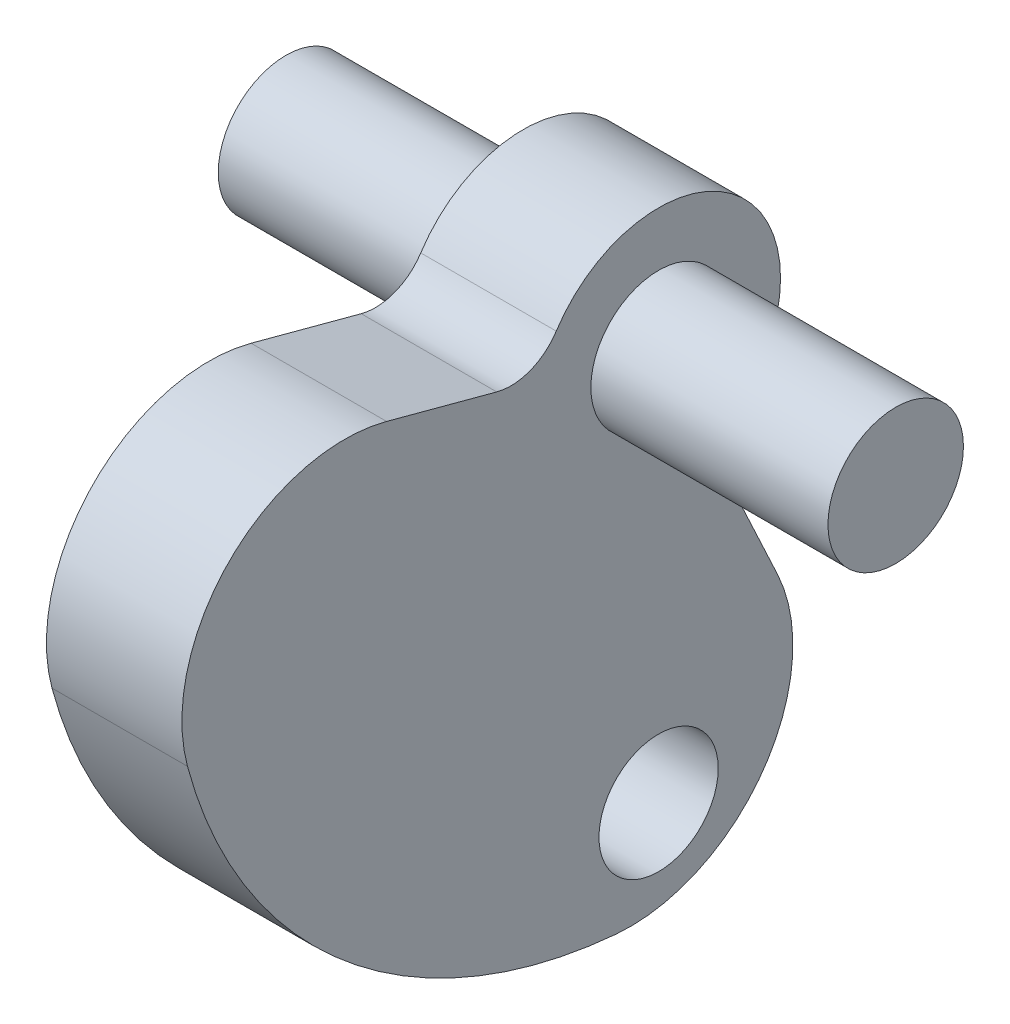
ISO-10303-21;
HEADER;
FILE_DESCRIPTION(('STEP AP214'),'2;1');
FILE_NAME('part.step','',(''),(''),'','','');
FILE_SCHEMA(('AUTOMOTIVE_DESIGN { 1 0 10303 214 1 1 1 1 }'));
ENDSEC;
DATA;
#1=APPLICATION_CONTEXT('core data for automotive mechanical design processes');
#2=APPLICATION_PROTOCOL_DEFINITION('international standard','automotive_design',2000,#1);
#3=PRODUCT_CONTEXT('',#1,'mechanical');
#4=PRODUCT('Part','Part','',(#3));
#5=PRODUCT_RELATED_PRODUCT_CATEGORY('part','',(#4));
#6=PRODUCT_DEFINITION_FORMATION('','',#4);
#7=PRODUCT_DEFINITION_CONTEXT('part definition',#1,'design');
#8=PRODUCT_DEFINITION('design','',#6,#7);
#9=PRODUCT_DEFINITION_SHAPE('','',#8);
#10=(LENGTH_UNIT() NAMED_UNIT(*) SI_UNIT(.MILLI.,.METRE.));
#11=(NAMED_UNIT(*) PLANE_ANGLE_UNIT() SI_UNIT($,.RADIAN.));
#12=(NAMED_UNIT(*) SI_UNIT($,.STERADIAN.) SOLID_ANGLE_UNIT());
#13=UNCERTAINTY_MEASURE_WITH_UNIT(LENGTH_MEASURE(1.E-05),#10,'distance_accuracy_value','');
#14=(GEOMETRIC_REPRESENTATION_CONTEXT(3) GLOBAL_UNCERTAINTY_ASSIGNED_CONTEXT((#13)) GLOBAL_UNIT_ASSIGNED_CONTEXT((#10,
#11,#12)) REPRESENTATION_CONTEXT('',''));
#15=CARTESIAN_POINT('',(0.,0.,0.));
#16=DIRECTION('',(0.,0.,1.));
#17=DIRECTION('',(1.,0.,0.));
#18=AXIS2_PLACEMENT_3D('',#15,#16,#17);
#19=CARTESIAN_POINT('',(3.175,4.48634998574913,6.92947969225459));
#20=DIRECTION('',(-1.,0.,0.));
#21=DIRECTION('',(0.,0.,1.));
#22=AXIS2_PLACEMENT_3D('',#19,#20,#21);
#23=PLANE('',#22);
#24=CARTESIAN_POINT('',(3.175,-18.4404,0.));
#25=DIRECTION('',(1.,0.,0.));
#26=DIRECTION('',(0.,0.,-1.));
#27=AXIS2_PLACEMENT_3D('',#24,#25,#26);
#28=CIRCLE('',#27,2.794);
#29=CARTESIAN_POINT('',(3.175,-18.4404,-2.794));
#30=VERTEX_POINT('',#29);
#31=EDGE_CURVE('E122',#30,#30,#28,.T.);
#32=ORIENTED_EDGE('',*,*,#31,.F.);
#33=EDGE_LOOP('',(#32));
#34=FACE_BOUND('',#33,.T.);
#35=DIRECTION('',(0.,0.258819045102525,0.965925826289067));
#36=VECTOR('',#35,1.);
#37=CARTESIAN_POINT('',(3.175,2.0328983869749,7.586880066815));
#38=LINE('',#37,#36);
#39=CARTESIAN_POINT('',(3.175,2.0328983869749,7.586880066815));
#40=VERTEX_POINT('',#39);
#41=CARTESIAN_POINT('',(3.175,3.41595254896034,12.7485084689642));
#42=VERTEX_POINT('',#41);
#43=EDGE_CURVE('E112',#40,#42,#38,.T.);
#44=ORIENTED_EDGE('',*,*,#43,.T.);
#45=CARTESIAN_POINT('',(3.175,-3.94440224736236,14.7207095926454));
#46=DIRECTION('',(-1.,0.,0.));
#47=DIRECTION('',(0.,0.,1.));
#48=AXIS2_PLACEMENT_3D('',#45,#46,#47);
#49=CIRCLE('',#48,7.62);
#50=CARTESIAN_POINT('',(3.175,-5.91660337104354,22.0810643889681));
#51=VERTEX_POINT('',#50);
#52=EDGE_CURVE('E40',#42,#51,#49,.F.);
#53=ORIENTED_EDGE('',*,*,#52,.T.);
#54=CARTESIAN_POINT('',(3.175,0.,0.));
#55=DIRECTION('',(1.,0.,0.));
#56=DIRECTION('',(0.,0.,-1.));
#57=AXIS2_PLACEMENT_3D('',#54,#55,#56);
#58=CIRCLE('',#57,22.86);
#59=CARTESIAN_POINT('',(3.175,-22.7730107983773,1.99238027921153));
#60=VERTEX_POINT('',#59);
#61=EDGE_CURVE('E140',#51,#60,#58,.T.);
#62=ORIENTED_EDGE('',*,*,#61,.T.);
#63=CARTESIAN_POINT('',(3.175,-15.1820071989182,1.32825351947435));
#64=DIRECTION('',(-1.,0.,0.));
#65=DIRECTION('',(0.,0.,1.));
#66=AXIS2_PLACEMENT_3D('',#63,#64,#65);
#67=CIRCLE('',#66,7.62);
#68=CARTESIAN_POINT('',(3.175,-11.9616560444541,-5.57781181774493));
#69=VERTEX_POINT('',#68);
#70=EDGE_CURVE('E47',#60,#69,#67,.F.);
#71=ORIENTED_EDGE('',*,*,#70,.T.);
#72=DIRECTION('',(0.,0.906307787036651,0.422618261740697));
#73=VECTOR('',#72,1.);
#74=CARTESIAN_POINT('',(3.175,-7.11860921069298,-3.31946199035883));
#75=LINE('',#74,#73);
#76=CARTESIAN_POINT('',(3.175,-7.11860921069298,-3.31946199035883));
#77=VERTEX_POINT('',#76);
#78=EDGE_CURVE('E142',#69,#77,#75,.T.);
#79=ORIENTED_EDGE('',*,*,#78,.T.);
#80=CARTESIAN_POINT('',(3.175,-6.04515882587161,-5.62148376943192));
#81=DIRECTION('',(-1.,0.,0.));
#82=DIRECTION('',(0.,0.,-1.));
#83=AXIS2_PLACEMENT_3D('',#80,#81,#82);
#84=CIRCLE('',#83,2.54);
#85=CARTESIAN_POINT('',(3.175,-4.18510995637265,-3.89179645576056));
#86=VERTEX_POINT('',#85);
#87=EDGE_CURVE('E144',#77,#86,#84,.T.);
#88=ORIENTED_EDGE('',*,*,#87,.T.);
#89=CARTESIAN_POINT('',(3.175,0.,0.));
#90=DIRECTION('',(1.,0.,0.));
#91=DIRECTION('',(0.,0.,1.));
#92=AXIS2_PLACEMENT_3D('',#89,#90,#91);
#93=CIRCLE('',#92,5.715);
#94=CARTESIAN_POINT('',(3.175,3.10593460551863,4.79733209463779));
#95=VERTEX_POINT('',#94);
#96=EDGE_CURVE('E146',#86,#95,#93,.T.);
#97=ORIENTED_EDGE('',*,*,#96,.T.);
#98=CARTESIAN_POINT('',(3.175,4.48634998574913,6.92947969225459));
#99=DIRECTION('',(-1.,0.,0.));
#100=DIRECTION('',(0.,0.,1.));
#101=AXIS2_PLACEMENT_3D('',#98,#99,#100);
#102=CIRCLE('',#101,2.54);
#103=EDGE_CURVE('E137',#95,#40,#102,.T.);
#104=ORIENTED_EDGE('',*,*,#103,.T.);
#105=EDGE_LOOP('',(#44,#53,#62,#71,#79,#88,#97,#104));
#106=FACE_BOUND('',#105,.T.);
#107=CARTESIAN_POINT('',(3.175,0.,0.));
#108=DIRECTION('',(-1.,0.,0.));
#109=DIRECTION('',(0.,0.,1.));
#110=AXIS2_PLACEMENT_3D('',#107,#108,#109);
#111=CIRCLE('',#110,3.175);
#112=CARTESIAN_POINT('',(3.175,0.,3.175));
#113=VERTEX_POINT('',#112);
#114=EDGE_CURVE('E116',#113,#113,#111,.F.);
#115=ORIENTED_EDGE('',*,*,#114,.F.);
#116=EDGE_LOOP('',(#115));
#117=FACE_BOUND('',#116,.T.);
#118=ADVANCED_FACE('F32',(#34,#106,#117),#23,.F.);
#119=CARTESIAN_POINT('',(-3.175,4.48634998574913,6.92947969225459));
#120=DIRECTION('',(-1.,0.,0.));
#121=DIRECTION('',(0.,0.,1.));
#122=AXIS2_PLACEMENT_3D('',#119,#120,#121);
#123=PLANE('',#122);
#124=CARTESIAN_POINT('',(-3.175,-18.4404,0.));
#125=DIRECTION('',(1.,0.,0.));
#126=DIRECTION('',(0.,0.,-1.));
#127=AXIS2_PLACEMENT_3D('',#124,#125,#126);
#128=CIRCLE('',#127,2.794);
#129=CARTESIAN_POINT('',(-3.175,-18.4404,-2.794));
#130=VERTEX_POINT('',#129);
#131=EDGE_CURVE('E125',#130,#130,#128,.T.);
#132=ORIENTED_EDGE('',*,*,#131,.T.);
#133=EDGE_LOOP('',(#132));
#134=FACE_BOUND('',#133,.T.);
#135=CARTESIAN_POINT('',(-3.175,0.,0.));
#136=DIRECTION('',(1.,0.,0.));
#137=DIRECTION('',(0.,0.,-1.));
#138=AXIS2_PLACEMENT_3D('',#135,#136,#137);
#139=CIRCLE('',#138,22.86);
#140=CARTESIAN_POINT('',(-3.175,-5.91660337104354,22.0810643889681));
#141=VERTEX_POINT('',#140);
#142=CARTESIAN_POINT('',(-3.175,-22.7730107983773,1.99238027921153));
#143=VERTEX_POINT('',#142);
#144=EDGE_CURVE('E107',#141,#143,#139,.T.);
#145=ORIENTED_EDGE('',*,*,#144,.F.);
#146=CARTESIAN_POINT('',(-3.175,-3.94440224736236,14.7207095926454));
#147=DIRECTION('',(-1.,0.,0.));
#148=DIRECTION('',(0.,0.,1.));
#149=AXIS2_PLACEMENT_3D('',#146,#147,#148);
#150=CIRCLE('',#149,7.62);
#151=CARTESIAN_POINT('',(-3.175,3.41595254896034,12.7485084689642));
#152=VERTEX_POINT('',#151);
#153=EDGE_CURVE('E106',#141,#152,#150,.T.);
#154=ORIENTED_EDGE('',*,*,#153,.T.);
#155=DIRECTION('',(0.,0.258819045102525,0.965925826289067));
#156=VECTOR('',#155,1.);
#157=CARTESIAN_POINT('',(-3.175,2.0328983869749,7.586880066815));
#158=LINE('',#157,#156);
#159=CARTESIAN_POINT('',(-3.175,2.0328983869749,7.586880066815));
#160=VERTEX_POINT('',#159);
#161=EDGE_CURVE('E98',#160,#152,#158,.T.);
#162=ORIENTED_EDGE('',*,*,#161,.F.);
#163=CARTESIAN_POINT('',(-3.175,4.48634998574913,6.92947969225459));
#164=DIRECTION('',(-1.,0.,0.));
#165=DIRECTION('',(0.,0.,1.));
#166=AXIS2_PLACEMENT_3D('',#163,#164,#165);
#167=CIRCLE('',#166,2.54);
#168=CARTESIAN_POINT('',(-3.175,3.10593460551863,4.79733209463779));
#169=VERTEX_POINT('',#168);
#170=EDGE_CURVE('E105',#169,#160,#167,.T.);
#171=ORIENTED_EDGE('',*,*,#170,.F.);
#172=CARTESIAN_POINT('',(-3.175,0.,0.));
#173=DIRECTION('',(1.,0.,0.));
#174=DIRECTION('',(0.,0.,1.));
#175=AXIS2_PLACEMENT_3D('',#172,#173,#174);
#176=CIRCLE('',#175,5.715);
#177=CARTESIAN_POINT('',(-3.175,-4.18510995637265,-3.89179645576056));
#178=VERTEX_POINT('',#177);
#179=EDGE_CURVE('E135',#178,#169,#176,.T.);
#180=ORIENTED_EDGE('',*,*,#179,.F.);
#181=CARTESIAN_POINT('',(-3.175,-6.04515882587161,-5.62148376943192));
#182=DIRECTION('',(-1.,0.,0.));
#183=DIRECTION('',(0.,0.,-1.));
#184=AXIS2_PLACEMENT_3D('',#181,#182,#183);
#185=CIRCLE('',#184,2.54);
#186=CARTESIAN_POINT('',(-3.175,-7.11860921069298,-3.31946199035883));
#187=VERTEX_POINT('',#186);
#188=EDGE_CURVE('E133',#187,#178,#185,.T.);
#189=ORIENTED_EDGE('',*,*,#188,.F.);
#190=DIRECTION('',(0.,0.906307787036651,0.422618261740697));
#191=VECTOR('',#190,1.);
#192=CARTESIAN_POINT('',(-3.175,-7.11860921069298,-3.31946199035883));
#193=LINE('',#192,#191);
#194=CARTESIAN_POINT('',(-3.175,-11.9616560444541,-5.57781181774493));
#195=VERTEX_POINT('',#194);
#196=EDGE_CURVE('E131',#195,#187,#193,.T.);
#197=ORIENTED_EDGE('',*,*,#196,.F.);
#198=CARTESIAN_POINT('',(-3.175,-15.1820071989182,1.32825351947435));
#199=DIRECTION('',(-1.,0.,0.));
#200=DIRECTION('',(0.,0.,1.));
#201=AXIS2_PLACEMENT_3D('',#198,#199,#200);
#202=CIRCLE('',#201,7.62);
#203=EDGE_CURVE('E163',#195,#143,#202,.T.);
#204=ORIENTED_EDGE('',*,*,#203,.T.);
#205=EDGE_LOOP('',(#145,#154,#162,#171,#180,#189,#197,#204));
#206=FACE_BOUND('',#205,.T.);
#207=CARTESIAN_POINT('',(-3.175,0.,0.));
#208=DIRECTION('',(-1.,0.,0.));
#209=DIRECTION('',(0.,0.,1.));
#210=AXIS2_PLACEMENT_3D('',#207,#208,#209);
#211=CIRCLE('',#210,3.175);
#212=CARTESIAN_POINT('',(-3.175,0.,3.175));
#213=VERTEX_POINT('',#212);
#214=EDGE_CURVE('E154',#213,#213,#211,.F.);
#215=ORIENTED_EDGE('',*,*,#214,.T.);
#216=EDGE_LOOP('',(#215));
#217=FACE_BOUND('',#216,.T.);
#218=ADVANCED_FACE('F101',(#134,#206,#217),#123,.T.);
#219=CARTESIAN_POINT('',(3.175,4.48634998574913,6.92947969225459));
#220=DIRECTION('',(-1.,0.,0.));
#221=DIRECTION('',(0.,0.,1.));
#222=AXIS2_PLACEMENT_3D('',#219,#220,#221);
#223=CYLINDRICAL_SURFACE('',#222,2.54);
#224=ORIENTED_EDGE('',*,*,#170,.T.);
#225=DIRECTION('',(-1.,0.,0.));
#226=VECTOR('',#225,1.);
#227=CARTESIAN_POINT('',(3.175,2.0328983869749,7.586880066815));
#228=LINE('',#227,#226);
#229=EDGE_CURVE('E110',#40,#160,#228,.T.);
#230=ORIENTED_EDGE('',*,*,#229,.F.);
#231=ORIENTED_EDGE('',*,*,#103,.F.);
#232=DIRECTION('',(-1.,0.,0.));
#233=VECTOR('',#232,1.);
#234=CARTESIAN_POINT('',(3.175,3.10593460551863,4.79733209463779));
#235=LINE('',#234,#233);
#236=EDGE_CURVE('E121',#95,#169,#235,.T.);
#237=ORIENTED_EDGE('',*,*,#236,.T.);
#238=EDGE_LOOP('',(#224,#230,#231,#237));
#239=FACE_BOUND('',#238,.T.);
#240=ADVANCED_FACE('F34',(#239),#223,.F.);
#241=CARTESIAN_POINT('',(3.175,2.0328983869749,7.586880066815));
#242=DIRECTION('',(0.,-0.965925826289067,0.258819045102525));
#243=DIRECTION('',(0.,-0.258819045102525,-0.965925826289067));
#244=AXIS2_PLACEMENT_3D('',#241,#242,#243);
#245=PLANE('',#244);
#246=ORIENTED_EDGE('',*,*,#161,.T.);
#247=DIRECTION('',(-1.,0.,0.));
#248=VECTOR('',#247,1.);
#249=CARTESIAN_POINT('',(3.175,3.41595254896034,12.7485084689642));
#250=LINE('',#249,#248);
#251=EDGE_CURVE('E55',#152,#42,#250,.F.);
#252=ORIENTED_EDGE('',*,*,#251,.T.);
#253=ORIENTED_EDGE('',*,*,#43,.F.);
#254=ORIENTED_EDGE('',*,*,#229,.T.);
#255=EDGE_LOOP('',(#246,#252,#253,#254));
#256=FACE_BOUND('',#255,.T.);
#257=ADVANCED_FACE('F111',(#256),#245,.F.);
#258=CARTESIAN_POINT('',(3.175,0.,0.));
#259=DIRECTION('',(-1.,0.,0.));
#260=DIRECTION('',(0.,0.,1.));
#261=AXIS2_PLACEMENT_3D('',#258,#259,#260);
#262=CYLINDRICAL_SURFACE('',#261,22.86);
#263=ORIENTED_EDGE('',*,*,#61,.F.);
#264=DIRECTION('',(-1.,0.,0.));
#265=VECTOR('',#264,1.);
#266=CARTESIAN_POINT('',(3.175,-5.91660337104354,22.0810643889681));
#267=LINE('',#266,#265);
#268=EDGE_CURVE('E160',#51,#141,#267,.T.);
#269=ORIENTED_EDGE('',*,*,#268,.T.);
#270=ORIENTED_EDGE('',*,*,#144,.T.);
#271=DIRECTION('',(-1.,0.,0.));
#272=VECTOR('',#271,1.);
#273=CARTESIAN_POINT('',(3.175,-22.7730107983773,1.99238027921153));
#274=LINE('',#273,#272);
#275=EDGE_CURVE('E158',#143,#60,#274,.F.);
#276=ORIENTED_EDGE('',*,*,#275,.T.);
#277=EDGE_LOOP('',(#263,#269,#270,#276));
#278=FACE_BOUND('',#277,.T.);
#279=ADVANCED_FACE('F173',(#278),#262,.T.);
#280=CARTESIAN_POINT('',(3.175,-7.11860921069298,-3.31946199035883));
#281=DIRECTION('',(0.,-0.422618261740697,0.906307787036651));
#282=DIRECTION('',(0.,-0.906307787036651,-0.422618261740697));
#283=AXIS2_PLACEMENT_3D('',#280,#281,#282);
#284=PLANE('',#283);
#285=ORIENTED_EDGE('',*,*,#78,.F.);
#286=DIRECTION('',(-1.,0.,0.));
#287=VECTOR('',#286,1.);
#288=CARTESIAN_POINT('',(3.175,-11.9616560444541,-5.57781181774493));
#289=LINE('',#288,#287);
#290=EDGE_CURVE('E11',#69,#195,#289,.T.);
#291=ORIENTED_EDGE('',*,*,#290,.T.);
#292=ORIENTED_EDGE('',*,*,#196,.T.);
#293=DIRECTION('',(-1.,0.,0.));
#294=VECTOR('',#293,1.);
#295=CARTESIAN_POINT('',(3.175,-7.11860921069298,-3.31946199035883));
#296=LINE('',#295,#294);
#297=EDGE_CURVE('E117',#77,#187,#296,.T.);
#298=ORIENTED_EDGE('',*,*,#297,.F.);
#299=EDGE_LOOP('',(#285,#291,#292,#298));
#300=FACE_BOUND('',#299,.T.);
#301=ADVANCED_FACE('F209',(#300),#284,.F.);
#302=CARTESIAN_POINT('',(3.175,-6.04515882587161,-5.62148376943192));
#303=DIRECTION('',(-1.,0.,0.));
#304=DIRECTION('',(0.,0.,1.));
#305=AXIS2_PLACEMENT_3D('',#302,#303,#304);
#306=CYLINDRICAL_SURFACE('',#305,2.54);
#307=ORIENTED_EDGE('',*,*,#188,.T.);
#308=DIRECTION('',(-1.,0.,0.));
#309=VECTOR('',#308,1.);
#310=CARTESIAN_POINT('',(3.175,-4.18510995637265,-3.89179645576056));
#311=LINE('',#310,#309);
#312=EDGE_CURVE('E149',#86,#178,#311,.T.);
#313=ORIENTED_EDGE('',*,*,#312,.F.);
#314=ORIENTED_EDGE('',*,*,#87,.F.);
#315=ORIENTED_EDGE('',*,*,#297,.T.);
#316=EDGE_LOOP('',(#307,#313,#314,#315));
#317=FACE_BOUND('',#316,.T.);
#318=ADVANCED_FACE('F205',(#317),#306,.F.);
#319=CARTESIAN_POINT('',(3.175,0.,0.));
#320=DIRECTION('',(-1.,0.,0.));
#321=DIRECTION('',(0.,0.,1.));
#322=AXIS2_PLACEMENT_3D('',#319,#320,#321);
#323=CYLINDRICAL_SURFACE('',#322,5.715);
#324=ORIENTED_EDGE('',*,*,#179,.T.);
#325=ORIENTED_EDGE('',*,*,#236,.F.);
#326=ORIENTED_EDGE('',*,*,#96,.F.);
#327=ORIENTED_EDGE('',*,*,#312,.T.);
#328=EDGE_LOOP('',(#324,#325,#326,#327));
#329=FACE_BOUND('',#328,.T.);
#330=ADVANCED_FACE('F201',(#329),#323,.T.);
#331=CARTESIAN_POINT('',(3.175,-18.4404,0.));
#332=DIRECTION('',(-1.,0.,0.));
#333=DIRECTION('',(0.,0.,1.));
#334=AXIS2_PLACEMENT_3D('',#331,#332,#333);
#335=CYLINDRICAL_SURFACE('',#334,2.794);
#336=ORIENTED_EDGE('',*,*,#31,.T.);
#337=EDGE_LOOP('',(#336));
#338=FACE_BOUND('',#337,.T.);
#339=ORIENTED_EDGE('',*,*,#131,.F.);
#340=EDGE_LOOP('',(#339));
#341=FACE_BOUND('',#340,.T.);
#342=ADVANCED_FACE('F204',(#338,#341),#335,.F.);
#343=CARTESIAN_POINT('',(-14.2875,0.,0.));
#344=DIRECTION('',(1.,0.,0.));
#345=DIRECTION('',(0.,0.,-1.));
#346=AXIS2_PLACEMENT_3D('',#343,#344,#345);
#347=PLANE('',#346);
#348=CARTESIAN_POINT('',(-14.2875,0.,0.));
#349=DIRECTION('',(1.,0.,0.));
#350=DIRECTION('',(0.,0.,-1.));
#351=AXIS2_PLACEMENT_3D('',#348,#349,#350);
#352=CIRCLE('',#351,3.175);
#353=CARTESIAN_POINT('',(-14.2875,0.,-3.175));
#354=VERTEX_POINT('',#353);
#355=EDGE_CURVE('E317',#354,#354,#352,.T.);
#356=ORIENTED_EDGE('',*,*,#355,.F.);
#357=EDGE_LOOP('',(#356));
#358=FACE_BOUND('',#357,.T.);
#359=ADVANCED_FACE('F280',(#358),#347,.F.);
#360=CARTESIAN_POINT('',(14.2875,0.,0.));
#361=DIRECTION('',(-1.,0.,0.));
#362=DIRECTION('',(0.,0.,1.));
#363=AXIS2_PLACEMENT_3D('',#360,#361,#362);
#364=CYLINDRICAL_SURFACE('',#363,3.175);
#365=ORIENTED_EDGE('',*,*,#214,.F.);
#366=EDGE_LOOP('',(#365));
#367=FACE_BOUND('',#366,.T.);
#368=ORIENTED_EDGE('',*,*,#355,.T.);
#369=EDGE_LOOP('',(#368));
#370=FACE_BOUND('',#369,.T.);
#371=ADVANCED_FACE('F271',(#367,#370),#364,.T.);
#372=CARTESIAN_POINT('',(14.2875,0.,0.));
#373=DIRECTION('',(1.,0.,0.));
#374=DIRECTION('',(0.,0.,-1.));
#375=AXIS2_PLACEMENT_3D('',#372,#373,#374);
#376=CIRCLE('',#375,3.175);
#377=CARTESIAN_POINT('',(14.2875,0.,-3.175));
#378=VERTEX_POINT('',#377);
#379=EDGE_CURVE('E157',#378,#378,#376,.T.);
#380=ORIENTED_EDGE('',*,*,#379,.F.);
#381=EDGE_LOOP('',(#380));
#382=FACE_BOUND('',#381,.T.);
#383=ORIENTED_EDGE('',*,*,#114,.T.);
#384=EDGE_LOOP('',(#383));
#385=FACE_BOUND('',#384,.T.);
#386=ADVANCED_FACE('F186',(#382,#385),#364,.T.);
#387=CARTESIAN_POINT('',(14.2875,0.,0.));
#388=DIRECTION('',(1.,0.,0.));
#389=DIRECTION('',(0.,0.,-1.));
#390=AXIS2_PLACEMENT_3D('',#387,#388,#389);
#391=PLANE('',#390);
#392=ORIENTED_EDGE('',*,*,#379,.T.);
#393=EDGE_LOOP('',(#392));
#394=FACE_BOUND('',#393,.T.);
#395=ADVANCED_FACE('F178',(#394),#391,.T.);
#396=CARTESIAN_POINT('',(3.175,-3.94440224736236,14.7207095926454));
#397=DIRECTION('',(-1.,0.,0.));
#398=DIRECTION('',(0.,0.,1.));
#399=AXIS2_PLACEMENT_3D('',#396,#397,#398);
#400=CYLINDRICAL_SURFACE('',#399,7.62);
#401=ORIENTED_EDGE('',*,*,#52,.F.);
#402=ORIENTED_EDGE('',*,*,#251,.F.);
#403=ORIENTED_EDGE('',*,*,#153,.F.);
#404=ORIENTED_EDGE('',*,*,#268,.F.);
#405=EDGE_LOOP('',(#401,#402,#403,#404));
#406=FACE_BOUND('',#405,.T.);
#407=ADVANCED_FACE('F175',(#406),#400,.T.);
#408=CARTESIAN_POINT('',(3.175,-15.1820071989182,1.32825351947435));
#409=DIRECTION('',(-1.,0.,0.));
#410=DIRECTION('',(0.,0.,1.));
#411=AXIS2_PLACEMENT_3D('',#408,#409,#410);
#412=CYLINDRICAL_SURFACE('',#411,7.62);
#413=ORIENTED_EDGE('',*,*,#70,.F.);
#414=ORIENTED_EDGE('',*,*,#275,.F.);
#415=ORIENTED_EDGE('',*,*,#203,.F.);
#416=ORIENTED_EDGE('',*,*,#290,.F.);
#417=EDGE_LOOP('',(#413,#414,#415,#416));
#418=FACE_BOUND('',#417,.T.);
#419=ADVANCED_FACE('F177',(#418),#412,.T.);
#420=CLOSED_SHELL('',(#118,#218,#240,#257,#279,#301,#318,#330,#342,#359,#371,#386,#395,#407,#419));
#421=MANIFOLD_SOLID_BREP('B2',#420);
#422=ADVANCED_BREP_SHAPE_REPRESENTATION('',(#18,#421),#14);
#423=SHAPE_DEFINITION_REPRESENTATION(#9,#422);
ENDSEC;
END-ISO-10303-21;
